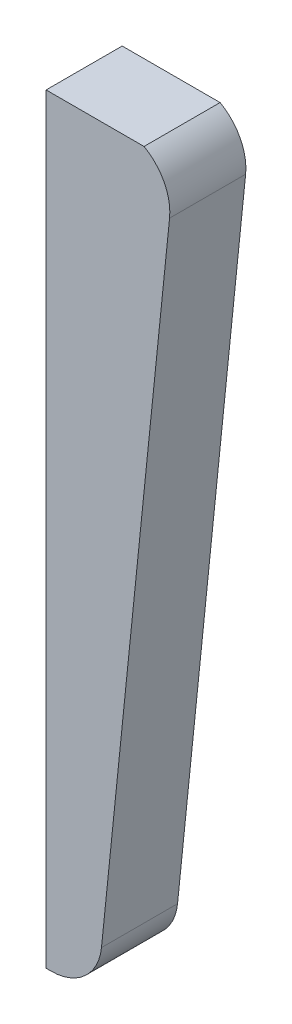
ISO-10303-21;
HEADER;
FILE_DESCRIPTION(('STEP AP214'),'2;1');
FILE_NAME('part.step','',(''),(''),'','','');
FILE_SCHEMA(('AUTOMOTIVE_DESIGN { 1 0 10303 214 1 1 1 1 }'));
ENDSEC;
DATA;
#1=APPLICATION_CONTEXT('core data for automotive mechanical design processes');
#2=APPLICATION_PROTOCOL_DEFINITION('international standard','automotive_design',2000,#1);
#3=PRODUCT_CONTEXT('',#1,'mechanical');
#4=PRODUCT('Part','Part','',(#3));
#5=PRODUCT_RELATED_PRODUCT_CATEGORY('part','',(#4));
#6=PRODUCT_DEFINITION_FORMATION('','',#4);
#7=PRODUCT_DEFINITION_CONTEXT('part definition',#1,'design');
#8=PRODUCT_DEFINITION('design','',#6,#7);
#9=PRODUCT_DEFINITION_SHAPE('','',#8);
#10=(LENGTH_UNIT() NAMED_UNIT(*) SI_UNIT(.MILLI.,.METRE.));
#11=(NAMED_UNIT(*) PLANE_ANGLE_UNIT() SI_UNIT($,.RADIAN.));
#12=(NAMED_UNIT(*) SI_UNIT($,.STERADIAN.) SOLID_ANGLE_UNIT());
#13=UNCERTAINTY_MEASURE_WITH_UNIT(LENGTH_MEASURE(1.E-05),#10,'distance_accuracy_value','');
#14=(GEOMETRIC_REPRESENTATION_CONTEXT(3) GLOBAL_UNCERTAINTY_ASSIGNED_CONTEXT((#13)) GLOBAL_UNIT_ASSIGNED_CONTEXT((#10,
#11,#12)) REPRESENTATION_CONTEXT('',''));
#15=CARTESIAN_POINT('',(0.,0.,0.));
#16=DIRECTION('',(0.,0.,1.));
#17=DIRECTION('',(1.,0.,0.));
#18=AXIS2_PLACEMENT_3D('',#15,#16,#17);
#19=CARTESIAN_POINT('',(-0.554939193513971,-2.34862385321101,3.));
#20=DIRECTION('',(1.,0.,0.));
#21=DIRECTION('',(0.,1.,0.));
#22=AXIS2_PLACEMENT_3D('',#19,#20,#21);
#23=PLANE('',#22);
#24=DIRECTION('',(0.,-1.,0.));
#25=VECTOR('',#24,1.);
#26=CARTESIAN_POINT('',(-0.554939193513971,-2.34862385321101,0.));
#27=LINE('',#26,#25);
#28=CARTESIAN_POINT('',(-0.554939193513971,-2.34862385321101,0.));
#29=VERTEX_POINT('',#28);
#30=CARTESIAN_POINT('',(-0.554939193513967,-32.348623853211,0.));
#31=VERTEX_POINT('',#30);
#32=EDGE_CURVE('E117',#29,#31,#27,.T.);
#33=ORIENTED_EDGE('',*,*,#32,.T.);
#34=DIRECTION('',(0.,0.,-1.));
#35=VECTOR('',#34,1.);
#36=CARTESIAN_POINT('',(-0.554939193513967,-32.348623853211,3.));
#37=LINE('',#36,#35);
#38=CARTESIAN_POINT('',(-0.554939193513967,-32.348623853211,3.));
#39=VERTEX_POINT('',#38);
#40=EDGE_CURVE('E11',#39,#31,#37,.T.);
#41=ORIENTED_EDGE('',*,*,#40,.F.);
#42=DIRECTION('',(0.,-1.,0.));
#43=VECTOR('',#42,1.);
#44=CARTESIAN_POINT('',(-0.554939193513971,-2.34862385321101,3.));
#45=LINE('',#44,#43);
#46=CARTESIAN_POINT('',(-0.554939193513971,-2.34862385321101,3.));
#47=VERTEX_POINT('',#46);
#48=EDGE_CURVE('E127',#47,#39,#45,.T.);
#49=ORIENTED_EDGE('',*,*,#48,.F.);
#50=DIRECTION('',(0.,0.,-1.));
#51=VECTOR('',#50,1.);
#52=CARTESIAN_POINT('',(-0.554939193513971,-2.34862385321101,3.));
#53=LINE('',#52,#51);
#54=EDGE_CURVE('E113',#47,#29,#53,.T.);
#55=ORIENTED_EDGE('',*,*,#54,.T.);
#56=EDGE_LOOP('',(#33,#41,#49,#55));
#57=FACE_BOUND('',#56,.T.);
#58=ADVANCED_FACE('F33',(#57),#23,.F.);
#59=CARTESIAN_POINT('',(-0.554939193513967,-32.348623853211,3.));
#60=DIRECTION('',(0.,1.,0.));
#61=DIRECTION('',(0.,0.,1.));
#62=AXIS2_PLACEMENT_3D('',#59,#60,#61);
#63=PLANE('',#62);
#64=DIRECTION('',(1.,0.,0.));
#65=VECTOR('',#64,1.);
#66=CARTESIAN_POINT('',(-0.554939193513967,-32.348623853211,0.));
#67=LINE('',#66,#65);
#68=CARTESIAN_POINT('',(-0.360836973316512,-32.348623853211,0.));
#69=VERTEX_POINT('',#68);
#70=EDGE_CURVE('E120',#31,#69,#67,.T.);
#71=ORIENTED_EDGE('',*,*,#70,.T.);
#72=DIRECTION('',(0.,0.,-1.));
#73=VECTOR('',#72,1.);
#74=CARTESIAN_POINT('',(-0.360836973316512,-32.348623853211,3.));
#75=LINE('',#74,#73);
#76=CARTESIAN_POINT('',(-0.360836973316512,-32.348623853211,3.));
#77=VERTEX_POINT('',#76);
#78=EDGE_CURVE('E41',#77,#69,#75,.T.);
#79=ORIENTED_EDGE('',*,*,#78,.F.);
#80=DIRECTION('',(1.,0.,0.));
#81=VECTOR('',#80,1.);
#82=CARTESIAN_POINT('',(-0.554939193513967,-32.348623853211,3.));
#83=LINE('',#82,#81);
#84=EDGE_CURVE('E86',#39,#77,#83,.T.);
#85=ORIENTED_EDGE('',*,*,#84,.F.);
#86=ORIENTED_EDGE('',*,*,#40,.T.);
#87=EDGE_LOOP('',(#71,#79,#85,#86));
#88=FACE_BOUND('',#87,.T.);
#89=ADVANCED_FACE('F151',(#88),#63,.F.);
#90=CARTESIAN_POINT('',(-0.360836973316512,-30.348623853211,3.));
#91=DIRECTION('',(0.,0.,-1.));
#92=DIRECTION('',(-1.,0.,0.));
#93=AXIS2_PLACEMENT_3D('',#90,#91,#92);
#94=CYLINDRICAL_SURFACE('',#93,2.);
#95=CARTESIAN_POINT('',(-0.360836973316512,-30.348623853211,0.));
#96=DIRECTION('',(0.,0.,1.));
#97=DIRECTION('',(1.,0.,0.));
#98=AXIS2_PLACEMENT_3D('',#95,#96,#97);
#99=CIRCLE('',#98,2.);
#100=CARTESIAN_POINT('',(1.62878586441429,-30.5520961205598,0.));
#101=VERTEX_POINT('',#100);
#102=EDGE_CURVE('E122',#69,#101,#99,.T.);
#103=ORIENTED_EDGE('',*,*,#102,.T.);
#104=DIRECTION('',(0.,0.,-1.));
#105=VECTOR('',#104,1.);
#106=CARTESIAN_POINT('',(1.62878586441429,-30.5520961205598,3.));
#107=LINE('',#106,#105);
#108=CARTESIAN_POINT('',(1.62878586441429,-30.5520961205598,3.));
#109=VERTEX_POINT('',#108);
#110=EDGE_CURVE('E108',#109,#101,#107,.T.);
#111=ORIENTED_EDGE('',*,*,#110,.F.);
#112=CARTESIAN_POINT('',(-0.360836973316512,-30.348623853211,3.));
#113=DIRECTION('',(0.,0.,1.));
#114=DIRECTION('',(1.,0.,0.));
#115=AXIS2_PLACEMENT_3D('',#112,#113,#114);
#116=CIRCLE('',#115,2.);
#117=EDGE_CURVE('E99',#77,#109,#116,.T.);
#118=ORIENTED_EDGE('',*,*,#117,.F.);
#119=ORIENTED_EDGE('',*,*,#78,.T.);
#120=EDGE_LOOP('',(#103,#111,#118,#119));
#121=FACE_BOUND('',#120,.T.);
#122=ADVANCED_FACE('F133',(#121),#94,.T.);
#123=CARTESIAN_POINT('',(1.62878586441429,-30.5520961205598,3.));
#124=DIRECTION('',(-0.994811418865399,0.101736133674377,0.));
#125=DIRECTION('',(-0.101736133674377,-0.994811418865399,0.));
#126=AXIS2_PLACEMENT_3D('',#123,#124,#125);
#127=PLANE('',#126);
#128=DIRECTION('',(0.101736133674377,0.994811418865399,0.));
#129=VECTOR('',#128,1.);
#130=CARTESIAN_POINT('',(1.62878586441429,-30.5520961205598,0.));
#131=LINE('',#130,#129);
#132=CARTESIAN_POINT('',(4.31411927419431,-4.29396891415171,0.));
#133=VERTEX_POINT('',#132);
#134=EDGE_CURVE('E107',#101,#133,#131,.T.);
#135=ORIENTED_EDGE('',*,*,#134,.T.);
#136=DIRECTION('',(0.,0.,-1.));
#137=VECTOR('',#136,1.);
#138=CARTESIAN_POINT('',(4.31411927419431,-4.29396891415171,3.));
#139=LINE('',#138,#137);
#140=CARTESIAN_POINT('',(4.31411927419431,-4.29396891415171,3.));
#141=VERTEX_POINT('',#140);
#142=EDGE_CURVE('E104',#141,#133,#139,.T.);
#143=ORIENTED_EDGE('',*,*,#142,.F.);
#144=DIRECTION('',(0.101736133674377,0.994811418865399,0.));
#145=VECTOR('',#144,1.);
#146=CARTESIAN_POINT('',(1.62878586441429,-30.5520961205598,3.));
#147=LINE('',#146,#145);
#148=EDGE_CURVE('E93',#109,#141,#147,.T.);
#149=ORIENTED_EDGE('',*,*,#148,.F.);
#150=ORIENTED_EDGE('',*,*,#110,.T.);
#151=EDGE_LOOP('',(#135,#143,#149,#150));
#152=FACE_BOUND('',#151,.T.);
#153=ADVANCED_FACE('F105',(#152),#127,.F.);
#154=CARTESIAN_POINT('',(2.32449643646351,-4.09049664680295,3.));
#155=DIRECTION('',(0.,0.,-1.));
#156=DIRECTION('',(-1.,0.,0.));
#157=AXIS2_PLACEMENT_3D('',#154,#155,#156);
#158=CYLINDRICAL_SURFACE('',#157,2.);
#159=CARTESIAN_POINT('',(2.32449643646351,-4.09049664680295,0.));
#160=DIRECTION('',(0.,0.,1.));
#161=DIRECTION('',(1.,0.,0.));
#162=AXIS2_PLACEMENT_3D('',#159,#160,#161);
#163=CIRCLE('',#162,2.);
#164=CARTESIAN_POINT('',(3.30728795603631,-2.34862385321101,0.));
#165=VERTEX_POINT('',#164);
#166=EDGE_CURVE('E72',#133,#165,#163,.T.);
#167=ORIENTED_EDGE('',*,*,#166,.T.);
#168=DIRECTION('',(0.,0.,-1.));
#169=VECTOR('',#168,1.);
#170=CARTESIAN_POINT('',(3.30728795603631,-2.34862385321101,3.));
#171=LINE('',#170,#169);
#172=CARTESIAN_POINT('',(3.30728795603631,-2.34862385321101,3.));
#173=VERTEX_POINT('',#172);
#174=EDGE_CURVE('E109',#173,#165,#171,.T.);
#175=ORIENTED_EDGE('',*,*,#174,.F.);
#176=CARTESIAN_POINT('',(2.32449643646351,-4.09049664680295,3.));
#177=DIRECTION('',(0.,0.,1.));
#178=DIRECTION('',(1.,0.,0.));
#179=AXIS2_PLACEMENT_3D('',#176,#177,#178);
#180=CIRCLE('',#179,2.);
#181=EDGE_CURVE('E97',#141,#173,#180,.T.);
#182=ORIENTED_EDGE('',*,*,#181,.F.);
#183=ORIENTED_EDGE('',*,*,#142,.T.);
#184=EDGE_LOOP('',(#167,#175,#182,#183));
#185=FACE_BOUND('',#184,.T.);
#186=ADVANCED_FACE('F111',(#185),#158,.T.);
#187=CARTESIAN_POINT('',(-0.554939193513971,-2.34862385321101,3.));
#188=DIRECTION('',(0.,-1.,0.));
#189=DIRECTION('',(0.,0.,-1.));
#190=AXIS2_PLACEMENT_3D('',#187,#188,#189);
#191=PLANE('',#190);
#192=DIRECTION('',(-1.,0.,0.));
#193=VECTOR('',#192,1.);
#194=CARTESIAN_POINT('',(-0.554939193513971,-2.34862385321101,0.));
#195=LINE('',#194,#193);
#196=EDGE_CURVE('E78',#165,#29,#195,.T.);
#197=ORIENTED_EDGE('',*,*,#196,.T.);
#198=ORIENTED_EDGE('',*,*,#54,.F.);
#199=DIRECTION('',(-1.,0.,0.));
#200=VECTOR('',#199,1.);
#201=CARTESIAN_POINT('',(-0.554939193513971,-2.34862385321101,3.));
#202=LINE('',#201,#200);
#203=EDGE_CURVE('E49',#173,#47,#202,.T.);
#204=ORIENTED_EDGE('',*,*,#203,.F.);
#205=ORIENTED_EDGE('',*,*,#174,.T.);
#206=EDGE_LOOP('',(#197,#198,#204,#205));
#207=FACE_BOUND('',#206,.T.);
#208=ADVANCED_FACE('F140',(#207),#191,.F.);
#209=CARTESIAN_POINT('',(-0.360836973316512,-30.348623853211,3.));
#210=DIRECTION('',(0.,0.,1.));
#211=DIRECTION('',(1.,0.,0.));
#212=AXIS2_PLACEMENT_3D('',#209,#210,#211);
#213=PLANE('',#212);
#214=ORIENTED_EDGE('',*,*,#48,.T.);
#215=ORIENTED_EDGE('',*,*,#84,.T.);
#216=ORIENTED_EDGE('',*,*,#117,.T.);
#217=ORIENTED_EDGE('',*,*,#148,.T.);
#218=ORIENTED_EDGE('',*,*,#181,.T.);
#219=ORIENTED_EDGE('',*,*,#203,.T.);
#220=EDGE_LOOP('',(#214,#215,#216,#217,#218,#219));
#221=FACE_BOUND('',#220,.T.);
#222=ADVANCED_FACE('F95',(#221),#213,.T.);
#223=CARTESIAN_POINT('',(-0.360836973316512,-30.348623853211,0.));
#224=DIRECTION('',(0.,0.,1.));
#225=DIRECTION('',(1.,0.,0.));
#226=AXIS2_PLACEMENT_3D('',#223,#224,#225);
#227=PLANE('',#226);
#228=ORIENTED_EDGE('',*,*,#32,.F.);
#229=ORIENTED_EDGE('',*,*,#196,.F.);
#230=ORIENTED_EDGE('',*,*,#166,.F.);
#231=ORIENTED_EDGE('',*,*,#134,.F.);
#232=ORIENTED_EDGE('',*,*,#102,.F.);
#233=ORIENTED_EDGE('',*,*,#70,.F.);
#234=EDGE_LOOP('',(#228,#229,#230,#231,#232,#233));
#235=FACE_BOUND('',#234,.T.);
#236=ADVANCED_FACE('F136',(#235),#227,.F.);
#237=CLOSED_SHELL('',(#58,#89,#122,#153,#186,#208,#222,#236));
#238=MANIFOLD_SOLID_BREP('B2',#237);
#239=ADVANCED_BREP_SHAPE_REPRESENTATION('',(#18,#238),#14);
#240=SHAPE_DEFINITION_REPRESENTATION(#9,#239);
ENDSEC;
END-ISO-10303-21;
